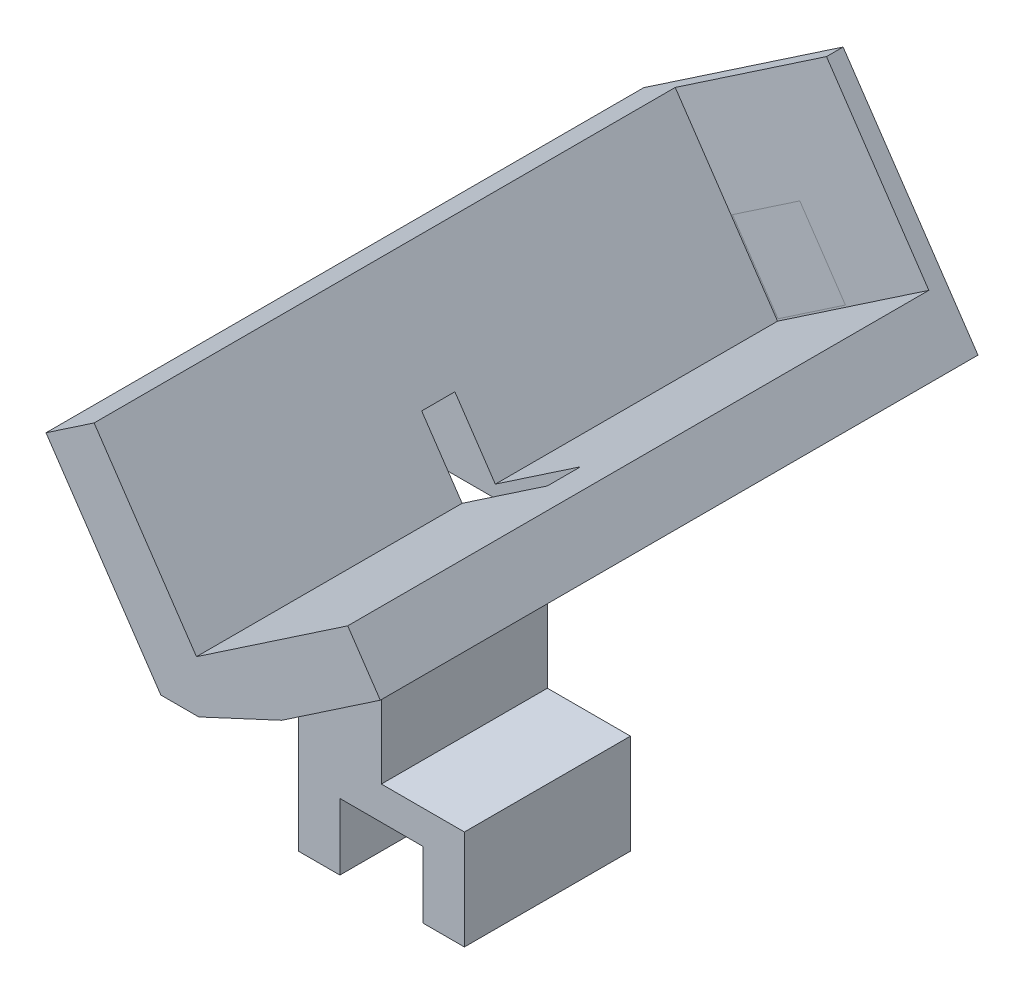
ISO-10303-21;
HEADER;
FILE_DESCRIPTION(('STEP AP214'),'2;1');
FILE_NAME('part.step','',(''),(''),'','','');
FILE_SCHEMA(('AUTOMOTIVE_DESIGN { 1 0 10303 214 1 1 1 1 }'));
ENDSEC;
DATA;
#1=APPLICATION_CONTEXT('core data for automotive mechanical design processes');
#2=APPLICATION_PROTOCOL_DEFINITION('international standard','automotive_design',2000,#1);
#3=PRODUCT_CONTEXT('',#1,'mechanical');
#4=PRODUCT('Part','Part','',(#3));
#5=PRODUCT_RELATED_PRODUCT_CATEGORY('part','',(#4));
#6=PRODUCT_DEFINITION_FORMATION('','',#4);
#7=PRODUCT_DEFINITION_CONTEXT('part definition',#1,'design');
#8=PRODUCT_DEFINITION('design','',#6,#7);
#9=PRODUCT_DEFINITION_SHAPE('','',#8);
#10=(LENGTH_UNIT() NAMED_UNIT(*) SI_UNIT(.MILLI.,.METRE.));
#11=(NAMED_UNIT(*) PLANE_ANGLE_UNIT() SI_UNIT($,.RADIAN.));
#12=(NAMED_UNIT(*) SI_UNIT($,.STERADIAN.) SOLID_ANGLE_UNIT());
#13=UNCERTAINTY_MEASURE_WITH_UNIT(LENGTH_MEASURE(1.E-05),#10,'distance_accuracy_value','');
#14=(GEOMETRIC_REPRESENTATION_CONTEXT(3) GLOBAL_UNCERTAINTY_ASSIGNED_CONTEXT((#13)) GLOBAL_UNIT_ASSIGNED_CONTEXT((#10,
#11,#12)) REPRESENTATION_CONTEXT('',''));
#15=CARTESIAN_POINT('',(0.,0.,0.));
#16=DIRECTION('',(0.,0.,1.));
#17=DIRECTION('',(1.,0.,0.));
#18=AXIS2_PLACEMENT_3D('',#15,#16,#17);
#19=CARTESIAN_POINT('',(-8.80199703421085,18.1854749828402,-19.));
#20=DIRECTION('',(0.,0.,-1.));
#21=DIRECTION('',(-1.,0.,0.));
#22=AXIS2_PLACEMENT_3D('',#19,#20,#21);
#23=PLANE('',#22);
#24=DIRECTION('',(-0.560408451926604,0.828216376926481,0.));
#25=VECTOR('',#24,1.);
#26=CARTESIAN_POINT('',(-2.6375040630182,9.07509483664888,-19.));
#27=LINE('',#26,#25);
#28=CARTESIAN_POINT('',(-2.6375040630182,9.07509483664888,-19.));
#29=VERTEX_POINT('',#28);
#30=CARTESIAN_POINT('',(-8.80199703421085,18.1854749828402,-19.));
#31=VERTEX_POINT('',#30);
#32=EDGE_CURVE('E660',#29,#31,#27,.T.);
#33=ORIENTED_EDGE('',*,*,#32,.F.);
#34=DIRECTION('',(-0.828216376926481,-0.560408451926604,0.));
#35=VECTOR('',#34,1.);
#36=CARTESIAN_POINT('',(-2.6375040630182,9.07509483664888,-19.));
#37=LINE('',#36,#35);
#38=CARTESIAN_POINT('',(6.47287608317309,15.2395878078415,-19.));
#39=VERTEX_POINT('',#38);
#40=EDGE_CURVE('E592',#39,#29,#37,.T.);
#41=ORIENTED_EDGE('',*,*,#40,.F.);
#42=DIRECTION('',(0.560408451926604,-0.828216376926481,0.));
#43=VECTOR('',#42,1.);
#44=CARTESIAN_POINT('',(6.47287608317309,15.2395878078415,-19.));
#45=LINE('',#44,#43);
#46=CARTESIAN_POINT('',(0.308383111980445,24.3499679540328,-19.));
#47=VERTEX_POINT('',#46);
#48=EDGE_CURVE('E598',#47,#39,#45,.T.);
#49=ORIENTED_EDGE('',*,*,#48,.F.);
#50=DIRECTION('',(0.828216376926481,0.560408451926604,0.));
#51=VECTOR('',#50,1.);
#52=CARTESIAN_POINT('',(-8.80199703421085,18.1854749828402,-19.));
#53=LINE('',#52,#51);
#54=EDGE_CURVE('E590',#31,#47,#53,.T.);
#55=ORIENTED_EDGE('',*,*,#54,.F.);
#56=EDGE_LOOP('',(#33,#41,#49,#55));
#57=FACE_BOUND('',#56,.T.);
#58=DIRECTION('',(-0.560408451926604,0.828216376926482,0.));
#59=VECTOR('',#58,1.);
#60=CARTESIAN_POINT('',(-4.66091514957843,20.9875172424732,-19.));
#61=LINE('',#60,#59);
#62=CARTESIAN_POINT('',(1.44753697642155,11.9599587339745,-19.));
#63=VERTEX_POINT('',#62);
#64=CARTESIAN_POINT('',(-1.29846443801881,16.0182189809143,-19.));
#65=VERTEX_POINT('',#64);
#66=EDGE_CURVE('E11',#63,#65,#61,.T.);
#67=ORIENTED_EDGE('',*,*,#66,.F.);
#68=DIRECTION('',(0.828216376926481,0.560408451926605,0.));
#69=VECTOR('',#68,1.);
#70=CARTESIAN_POINT('',(-2.69354490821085,9.15791647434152,-19.));
#71=LINE('',#70,#69);
#72=CARTESIAN_POINT('',(-2.61072327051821,9.21395731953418,-19.));
#73=VERTEX_POINT('',#72);
#74=EDGE_CURVE('E324',#73,#63,#71,.T.);
#75=ORIENTED_EDGE('',*,*,#74,.F.);
#76=DIRECTION('',(0.560408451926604,-0.828216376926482,0.));
#77=VECTOR('',#76,1.);
#78=CARTESIAN_POINT('',(-8.7191753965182,18.2415158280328,-19.));
#79=LINE('',#78,#77);
#80=CARTESIAN_POINT('',(-5.35672468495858,13.2722175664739,-19.));
#81=VERTEX_POINT('',#80);
#82=EDGE_CURVE('E328',#81,#73,#79,.T.);
#83=ORIENTED_EDGE('',*,*,#82,.F.);
#84=DIRECTION('',(-0.828216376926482,-0.560408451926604,0.));
#85=VECTOR('',#84,1.);
#86=CARTESIAN_POINT('',(-5.43954632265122,13.2161767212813,-19.));
#87=LINE('',#86,#85);
#88=EDGE_CURVE('E45',#65,#81,#87,.T.);
#89=ORIENTED_EDGE('',*,*,#88,.F.);
#90=EDGE_LOOP('',(#67,#75,#83,#89));
#91=FACE_BOUND('',#90,.T.);
#92=ADVANCED_FACE('F36',(#57,#91),#23,.F.);
#93=CARTESIAN_POINT('',(-8.80199703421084,18.1854749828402,0.));
#94=DIRECTION('',(0.828216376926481,0.560408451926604,0.));
#95=DIRECTION('',(-0.560408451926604,0.828216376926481,0.));
#96=AXIS2_PLACEMENT_3D('',#93,#94,#95);
#97=PLANE('',#96);
#98=DIRECTION('',(0.,0.,1.));
#99=VECTOR('',#98,1.);
#100=CARTESIAN_POINT('',(-2.6375040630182,9.07509483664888,0.));
#101=LINE('',#100,#99);
#102=CARTESIAN_POINT('',(-2.6375040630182,9.07509483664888,-2.));
#103=VERTEX_POINT('',#102);
#104=EDGE_CURVE('E297',#29,#103,#101,.T.);
#105=ORIENTED_EDGE('',*,*,#104,.F.);
#106=ORIENTED_EDGE('',*,*,#32,.T.);
#107=DIRECTION('',(0.,0.,1.));
#108=VECTOR('',#107,1.);
#109=CARTESIAN_POINT('',(-8.80199703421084,18.1854749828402,0.));
#110=LINE('',#109,#108);
#111=CARTESIAN_POINT('',(-8.80199703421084,18.1854749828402,16.));
#112=VERTEX_POINT('',#111);
#113=EDGE_CURVE('E295',#31,#112,#110,.T.);
#114=ORIENTED_EDGE('',*,*,#113,.T.);
#115=DIRECTION('',(0.560408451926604,-0.828216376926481,0.));
#116=VECTOR('',#115,1.);
#117=CARTESIAN_POINT('',(-8.80199703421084,18.1854749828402,16.));
#118=LINE('',#117,#116);
#119=CARTESIAN_POINT('',(-2.6375040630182,9.07509483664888,16.));
#120=VERTEX_POINT('',#119);
#121=EDGE_CURVE('E266',#112,#120,#118,.T.);
#122=ORIENTED_EDGE('',*,*,#121,.T.);
#123=CARTESIAN_POINT('',(-2.6375040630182,9.07509483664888,0.));
#124=VERTEX_POINT('',#123);
#125=EDGE_CURVE('E299',#124,#120,#101,.T.);
#126=ORIENTED_EDGE('',*,*,#125,.F.);
#127=DIRECTION('',(0.560408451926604,-0.828216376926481,0.));
#128=VECTOR('',#127,1.);
#129=CARTESIAN_POINT('',(-8.80199703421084,18.1854749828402,0.));
#130=LINE('',#129,#128);
#131=CARTESIAN_POINT('',(-5.07362573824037,12.6753900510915,0.));
#132=VERTEX_POINT('',#131);
#133=EDGE_CURVE('E563',#132,#124,#130,.T.);
#134=ORIENTED_EDGE('',*,*,#133,.F.);
#135=DIRECTION('',(0.,0.,1.));
#136=VECTOR('',#135,1.);
#137=CARTESIAN_POINT('',(-5.07362573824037,12.6753900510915,0.));
#138=LINE('',#137,#136);
#139=CARTESIAN_POINT('',(-5.07362573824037,12.6753900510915,-2.));
#140=VERTEX_POINT('',#139);
#141=EDGE_CURVE('E322',#140,#132,#138,.T.);
#142=ORIENTED_EDGE('',*,*,#141,.F.);
#143=DIRECTION('',(0.560408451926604,-0.828216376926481,0.));
#144=VECTOR('',#143,1.);
#145=CARTESIAN_POINT('',(-8.80199703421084,18.1854749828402,-2.));
#146=LINE('',#145,#144);
#147=EDGE_CURVE('E575',#140,#103,#146,.T.);
#148=ORIENTED_EDGE('',*,*,#147,.T.);
#149=EDGE_LOOP('',(#105,#106,#114,#122,#126,#134,#142,#148));
#150=FACE_BOUND('',#149,.T.);
#151=ADVANCED_FACE('F343',(#150),#97,.T.);
#152=CARTESIAN_POINT('',(-2.6375040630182,9.07509483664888,0.));
#153=DIRECTION('',(-0.560408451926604,0.828216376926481,0.));
#154=DIRECTION('',(-0.828216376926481,-0.560408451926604,0.));
#155=AXIS2_PLACEMENT_3D('',#152,#153,#154);
#156=PLANE('',#155);
#157=DIRECTION('',(0.,0.,1.));
#158=VECTOR('',#157,1.);
#159=CARTESIAN_POINT('',(6.47287608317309,15.2395878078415,0.));
#160=LINE('',#159,#158);
#161=CARTESIAN_POINT('',(6.47287608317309,15.2395878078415,16.));
#162=VERTEX_POINT('',#161);
#163=EDGE_CURVE('E300',#39,#162,#160,.T.);
#164=ORIENTED_EDGE('',*,*,#163,.F.);
#165=ORIENTED_EDGE('',*,*,#40,.T.);
#166=ORIENTED_EDGE('',*,*,#104,.T.);
#167=DIRECTION('',(0.828216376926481,0.560408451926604,0.));
#168=VECTOR('',#167,1.);
#169=CARTESIAN_POINT('',(-2.6375040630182,9.07509483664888,-2.));
#170=LINE('',#169,#168);
#171=CARTESIAN_POINT('',(2.5,12.5513611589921,-2.));
#172=VERTEX_POINT('',#171);
#173=EDGE_CURVE('E572',#103,#172,#170,.T.);
#174=ORIENTED_EDGE('',*,*,#173,.T.);
#175=DIRECTION('',(0.,0.,-1.));
#176=VECTOR('',#175,1.);
#177=CARTESIAN_POINT('',(2.5,12.5513611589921,0.));
#178=LINE('',#177,#176);
#179=CARTESIAN_POINT('',(2.5,12.5513611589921,0.));
#180=VERTEX_POINT('',#179);
#181=EDGE_CURVE('E578',#180,#172,#178,.T.);
#182=ORIENTED_EDGE('',*,*,#181,.F.);
#183=DIRECTION('',(0.828216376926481,0.560408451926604,0.));
#184=VECTOR('',#183,1.);
#185=CARTESIAN_POINT('',(-2.6375040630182,9.07509483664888,0.));
#186=LINE('',#185,#184);
#187=EDGE_CURVE('E561',#124,#180,#186,.T.);
#188=ORIENTED_EDGE('',*,*,#187,.F.);
#189=ORIENTED_EDGE('',*,*,#125,.T.);
#190=DIRECTION('',(0.828216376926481,0.560408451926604,0.));
#191=VECTOR('',#190,1.);
#192=CARTESIAN_POINT('',(-2.6375040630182,9.07509483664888,16.));
#193=LINE('',#192,#191);
#194=EDGE_CURVE('E269',#120,#162,#193,.T.);
#195=ORIENTED_EDGE('',*,*,#194,.T.);
#196=EDGE_LOOP('',(#164,#165,#166,#174,#182,#188,#189,#195));
#197=FACE_BOUND('',#196,.T.);
#198=ADVANCED_FACE('F349',(#197),#156,.T.);
#199=CARTESIAN_POINT('',(-4.78270538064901,6.,0.));
#200=DIRECTION('',(-0.828216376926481,-0.560408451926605,0.));
#201=DIRECTION('',(0.560408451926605,-0.828216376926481,0.));
#202=AXIS2_PLACEMENT_3D('',#199,#200,#201);
#203=PLANE('',#202);
#204=DIRECTION('',(0.,0.,-1.));
#205=VECTOR('',#204,1.);
#206=CARTESIAN_POINT('',(-6.35618397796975,8.32541236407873,0.));
#207=LINE('',#206,#205);
#208=CARTESIAN_POINT('',(-6.35618397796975,8.32541236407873,-2.));
#209=VERTEX_POINT('',#208);
#210=CARTESIAN_POINT('',(-6.35618397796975,8.32541236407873,-20.));
#211=VERTEX_POINT('',#210);
#212=EDGE_CURVE('E231',#209,#211,#207,.T.);
#213=ORIENTED_EDGE('',*,*,#212,.F.);
#214=DIRECTION('',(-0.560408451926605,0.828216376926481,0.));
#215=VECTOR('',#214,1.);
#216=CARTESIAN_POINT('',(-4.78270538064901,6.,-2.));
#217=LINE('',#216,#215);
#218=CARTESIAN_POINT('',(-9.29957453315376,12.6753900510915,-2.));
#219=VERTEX_POINT('',#218);
#220=EDGE_CURVE('E570',#209,#219,#217,.T.);
#221=ORIENTED_EDGE('',*,*,#220,.T.);
#222=DIRECTION('',(0.,0.,-1.));
#223=VECTOR('',#222,1.);
#224=CARTESIAN_POINT('',(-9.29957453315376,12.6753900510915,0.));
#225=LINE('',#224,#223);
#226=CARTESIAN_POINT('',(-9.29957453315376,12.6753900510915,0.));
#227=VERTEX_POINT('',#226);
#228=EDGE_CURVE('E580',#227,#219,#225,.T.);
#229=ORIENTED_EDGE('',*,*,#228,.F.);
#230=DIRECTION('',(0.,0.,-1.));
#231=VECTOR('',#230,1.);
#232=CARTESIAN_POINT('',(-9.29957453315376,12.6753900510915,1.));
#233=LINE('',#232,#231);
#234=CARTESIAN_POINT('',(-9.29957453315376,12.6753900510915,1.));
#235=VERTEX_POINT('',#234);
#236=EDGE_CURVE('E622',#235,#227,#233,.T.);
#237=ORIENTED_EDGE('',*,*,#236,.F.);
#238=DIRECTION('',(0.560408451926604,-0.828216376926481,0.));
#239=VECTOR('',#238,1.);
#240=CARTESIAN_POINT('',(-8.17875762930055,11.0189572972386,1.));
#241=LINE('',#240,#239);
#242=CARTESIAN_POINT('',(-8.17875762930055,11.0189572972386,1.));
#243=VERTEX_POINT('',#242);
#244=EDGE_CURVE('E605',#235,#243,#241,.T.);
#245=ORIENTED_EDGE('',*,*,#244,.T.);
#246=DIRECTION('',(0.,0.,-1.));
#247=VECTOR('',#246,1.);
#248=CARTESIAN_POINT('',(-8.17875762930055,11.0189572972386,1.));
#249=LINE('',#248,#247);
#250=CARTESIAN_POINT('',(-8.17875762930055,11.0189572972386,0.));
#251=VERTEX_POINT('',#250);
#252=EDGE_CURVE('E559',#243,#251,#249,.T.);
#253=ORIENTED_EDGE('',*,*,#252,.T.);
#254=DIRECTION('',(-0.560408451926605,0.828216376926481,0.));
#255=VECTOR('',#254,1.);
#256=CARTESIAN_POINT('',(-4.78270538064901,6.,0.));
#257=LINE('',#256,#255);
#258=CARTESIAN_POINT('',(-4.78270538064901,6.,0.));
#259=VERTEX_POINT('',#258);
#260=EDGE_CURVE('E557',#259,#251,#257,.T.);
#261=ORIENTED_EDGE('',*,*,#260,.F.);
#262=DIRECTION('',(0.,0.,1.));
#263=VECTOR('',#262,1.);
#264=CARTESIAN_POINT('',(-4.78270538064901,6.,0.));
#265=LINE('',#264,#263);
#266=CARTESIAN_POINT('',(-4.78270538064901,6.,16.));
#267=VERTEX_POINT('',#266);
#268=EDGE_CURVE('E291',#259,#267,#265,.T.);
#269=ORIENTED_EDGE('',*,*,#268,.T.);
#270=DIRECTION('',(-0.560408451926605,0.828216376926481,0.));
#271=VECTOR('',#270,1.);
#272=CARTESIAN_POINT('',(-4.78270538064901,6.,16.));
#273=LINE('',#272,#271);
#274=CARTESIAN_POINT('',(-11.7007543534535,16.2240454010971,16.));
#275=VERTEX_POINT('',#274);
#276=EDGE_CURVE('E255',#267,#275,#273,.T.);
#277=ORIENTED_EDGE('',*,*,#276,.T.);
#278=DIRECTION('',(0.,0.,1.));
#279=VECTOR('',#278,1.);
#280=CARTESIAN_POINT('',(-11.7007543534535,16.2240454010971,0.));
#281=LINE('',#280,#279);
#282=CARTESIAN_POINT('',(-11.7007543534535,16.2240454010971,-20.));
#283=VERTEX_POINT('',#282);
#284=EDGE_CURVE('E293',#283,#275,#281,.T.);
#285=ORIENTED_EDGE('',*,*,#284,.F.);
#286=DIRECTION('',(-0.560408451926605,0.828216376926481,0.));
#287=VECTOR('',#286,1.);
#288=CARTESIAN_POINT('',(-4.78270538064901,6.,-20.));
#289=LINE('',#288,#287);
#290=EDGE_CURVE('E583',#211,#283,#289,.T.);
#291=ORIENTED_EDGE('',*,*,#290,.F.);
#292=EDGE_LOOP('',(#213,#221,#229,#237,#245,#253,#261,#269,#277,#285,#291));
#293=FACE_BOUND('',#292,.T.);
#294=ADVANCED_FACE('F411',(#293),#203,.T.);
#295=CARTESIAN_POINT('',(0.,-4.,10.));
#296=DIRECTION('',(-1.,0.,0.));
#297=DIRECTION('',(0.,0.,1.));
#298=AXIS2_PLACEMENT_3D('',#295,#296,#297);
#299=PLANE('',#298);
#300=DIRECTION('',(0.,1.,0.));
#301=VECTOR('',#300,1.);
#302=CARTESIAN_POINT('',(0.,-4.,0.));
#303=LINE('',#302,#301);
#304=CARTESIAN_POINT('',(0.,-4.,0.));
#305=VERTEX_POINT('',#304);
#306=CARTESIAN_POINT('',(0.,0.,0.));
#307=VERTEX_POINT('',#306);
#308=EDGE_CURVE('E290',#305,#307,#303,.T.);
#309=ORIENTED_EDGE('',*,*,#308,.T.);
#310=DIRECTION('',(0.,0.,-1.));
#311=VECTOR('',#310,1.);
#312=CARTESIAN_POINT('',(0.,0.,10.));
#313=LINE('',#312,#311);
#314=CARTESIAN_POINT('',(0.,0.,10.));
#315=VERTEX_POINT('',#314);
#316=EDGE_CURVE('E325',#315,#307,#313,.T.);
#317=ORIENTED_EDGE('',*,*,#316,.F.);
#318=DIRECTION('',(0.,1.,0.));
#319=VECTOR('',#318,1.);
#320=CARTESIAN_POINT('',(0.,-4.,10.));
#321=LINE('',#320,#319);
#322=CARTESIAN_POINT('',(0.,-4.,10.));
#323=VERTEX_POINT('',#322);
#324=EDGE_CURVE('E309',#323,#315,#321,.T.);
#325=ORIENTED_EDGE('',*,*,#324,.F.);
#326=DIRECTION('',(0.,0.,-1.));
#327=VECTOR('',#326,1.);
#328=CARTESIAN_POINT('',(0.,-4.,10.));
#329=LINE('',#328,#327);
#330=EDGE_CURVE('E515',#323,#305,#329,.T.);
#331=ORIENTED_EDGE('',*,*,#330,.T.);
#332=EDGE_LOOP('',(#309,#317,#325,#331));
#333=FACE_BOUND('',#332,.T.);
#334=ADVANCED_FACE('F38',(#333),#299,.F.);
#335=CARTESIAN_POINT('',(0.,0.,10.));
#336=DIRECTION('',(0.,1.,0.));
#337=DIRECTION('',(0.,0.,1.));
#338=AXIS2_PLACEMENT_3D('',#335,#336,#337);
#339=PLANE('',#338);
#340=DIRECTION('',(1.,0.,0.));
#341=VECTOR('',#340,1.);
#342=CARTESIAN_POINT('',(0.,0.,0.));
#343=LINE('',#342,#341);
#344=CARTESIAN_POINT('',(5.,0.,0.));
#345=VERTEX_POINT('',#344);
#346=EDGE_CURVE('E469',#307,#345,#343,.T.);
#347=ORIENTED_EDGE('',*,*,#346,.T.);
#348=DIRECTION('',(0.,0.,-1.));
#349=VECTOR('',#348,1.);
#350=CARTESIAN_POINT('',(5.,0.,10.));
#351=LINE('',#350,#349);
#352=CARTESIAN_POINT('',(5.,0.,10.));
#353=VERTEX_POINT('',#352);
#354=EDGE_CURVE('E471',#353,#345,#351,.T.);
#355=ORIENTED_EDGE('',*,*,#354,.F.);
#356=DIRECTION('',(1.,0.,0.));
#357=VECTOR('',#356,1.);
#358=CARTESIAN_POINT('',(0.,0.,10.));
#359=LINE('',#358,#357);
#360=EDGE_CURVE('E524',#315,#353,#359,.T.);
#361=ORIENTED_EDGE('',*,*,#360,.F.);
#362=ORIENTED_EDGE('',*,*,#316,.T.);
#363=EDGE_LOOP('',(#347,#355,#361,#362));
#364=FACE_BOUND('',#363,.T.);
#365=ADVANCED_FACE('F459',(#364),#339,.F.);
#366=CARTESIAN_POINT('',(5.,0.,10.));
#367=DIRECTION('',(1.,0.,0.));
#368=DIRECTION('',(0.,1.,0.));
#369=AXIS2_PLACEMENT_3D('',#366,#367,#368);
#370=PLANE('',#369);
#371=DIRECTION('',(0.,-1.,0.));
#372=VECTOR('',#371,1.);
#373=CARTESIAN_POINT('',(5.,0.,0.));
#374=LINE('',#373,#372);
#375=CARTESIAN_POINT('',(5.,-4.,0.));
#376=VERTEX_POINT('',#375);
#377=EDGE_CURVE('E477',#345,#376,#374,.T.);
#378=ORIENTED_EDGE('',*,*,#377,.T.);
#379=DIRECTION('',(0.,0.,-1.));
#380=VECTOR('',#379,1.);
#381=CARTESIAN_POINT('',(5.,-4.,10.));
#382=LINE('',#381,#380);
#383=CARTESIAN_POINT('',(5.,-4.,10.));
#384=VERTEX_POINT('',#383);
#385=EDGE_CURVE('E482',#384,#376,#382,.T.);
#386=ORIENTED_EDGE('',*,*,#385,.F.);
#387=DIRECTION('',(0.,-1.,0.));
#388=VECTOR('',#387,1.);
#389=CARTESIAN_POINT('',(5.,0.,10.));
#390=LINE('',#389,#388);
#391=EDGE_CURVE('E481',#353,#384,#390,.T.);
#392=ORIENTED_EDGE('',*,*,#391,.F.);
#393=ORIENTED_EDGE('',*,*,#354,.T.);
#394=EDGE_LOOP('',(#378,#386,#392,#393));
#395=FACE_BOUND('',#394,.T.);
#396=ADVANCED_FACE('F456',(#395),#370,.F.);
#397=CARTESIAN_POINT('',(5.,-4.,10.));
#398=DIRECTION('',(0.,1.,0.));
#399=DIRECTION('',(0.,0.,1.));
#400=AXIS2_PLACEMENT_3D('',#397,#398,#399);
#401=PLANE('',#400);
#402=DIRECTION('',(1.,0.,0.));
#403=VECTOR('',#402,1.);
#404=CARTESIAN_POINT('',(5.,-4.,0.));
#405=LINE('',#404,#403);
#406=CARTESIAN_POINT('',(7.5,-4.,0.));
#407=VERTEX_POINT('',#406);
#408=EDGE_CURVE('E488',#376,#407,#405,.T.);
#409=ORIENTED_EDGE('',*,*,#408,.T.);
#410=DIRECTION('',(0.,0.,-1.));
#411=VECTOR('',#410,1.);
#412=CARTESIAN_POINT('',(7.5,-4.,10.));
#413=LINE('',#412,#411);
#414=CARTESIAN_POINT('',(7.5,-4.,10.));
#415=VERTEX_POINT('',#414);
#416=EDGE_CURVE('E532',#415,#407,#413,.T.);
#417=ORIENTED_EDGE('',*,*,#416,.F.);
#418=DIRECTION('',(1.,0.,0.));
#419=VECTOR('',#418,1.);
#420=CARTESIAN_POINT('',(5.,-4.,10.));
#421=LINE('',#420,#419);
#422=EDGE_CURVE('E537',#384,#415,#421,.T.);
#423=ORIENTED_EDGE('',*,*,#422,.F.);
#424=ORIENTED_EDGE('',*,*,#385,.T.);
#425=EDGE_LOOP('',(#409,#417,#423,#424));
#426=FACE_BOUND('',#425,.T.);
#427=ADVANCED_FACE('F452',(#426),#401,.F.);
#428=CARTESIAN_POINT('',(7.5,-4.,10.));
#429=DIRECTION('',(-1.,0.,0.));
#430=DIRECTION('',(0.,-1.,0.));
#431=AXIS2_PLACEMENT_3D('',#428,#429,#430);
#432=PLANE('',#431);
#433=DIRECTION('',(0.,1.,0.));
#434=VECTOR('',#433,1.);
#435=CARTESIAN_POINT('',(7.5,-4.,0.));
#436=LINE('',#435,#434);
#437=CARTESIAN_POINT('',(7.5,2.,0.));
#438=VERTEX_POINT('',#437);
#439=EDGE_CURVE('E490',#407,#438,#436,.T.);
#440=ORIENTED_EDGE('',*,*,#439,.T.);
#441=DIRECTION('',(0.,0.,-1.));
#442=VECTOR('',#441,1.);
#443=CARTESIAN_POINT('',(7.5,2.,10.));
#444=LINE('',#443,#442);
#445=CARTESIAN_POINT('',(7.5,2.,10.));
#446=VERTEX_POINT('',#445);
#447=EDGE_CURVE('E529',#446,#438,#444,.T.);
#448=ORIENTED_EDGE('',*,*,#447,.F.);
#449=DIRECTION('',(0.,1.,0.));
#450=VECTOR('',#449,1.);
#451=CARTESIAN_POINT('',(7.5,-4.,10.));
#452=LINE('',#451,#450);
#453=EDGE_CURVE('E508',#415,#446,#452,.T.);
#454=ORIENTED_EDGE('',*,*,#453,.F.);
#455=ORIENTED_EDGE('',*,*,#416,.T.);
#456=EDGE_LOOP('',(#440,#448,#454,#455));
#457=FACE_BOUND('',#456,.T.);
#458=ADVANCED_FACE('F448',(#457),#432,.F.);
#459=CARTESIAN_POINT('',(7.5,2.,10.));
#460=DIRECTION('',(0.,-1.,0.));
#461=DIRECTION('',(0.,0.,-1.));
#462=AXIS2_PLACEMENT_3D('',#459,#460,#461);
#463=PLANE('',#462);
#464=DIRECTION('',(-1.,0.,0.));
#465=VECTOR('',#464,1.);
#466=CARTESIAN_POINT('',(7.5,2.,0.));
#467=LINE('',#466,#465);
#468=CARTESIAN_POINT('',(2.5,2.,0.));
#469=VERTEX_POINT('',#468);
#470=EDGE_CURVE('E495',#438,#469,#467,.T.);
#471=ORIENTED_EDGE('',*,*,#470,.T.);
#472=DIRECTION('',(0.,0.,1.));
#473=VECTOR('',#472,1.);
#474=CARTESIAN_POINT('',(2.5,2.,0.));
#475=LINE('',#474,#473);
#476=CARTESIAN_POINT('',(2.5,2.,10.));
#477=VERTEX_POINT('',#476);
#478=EDGE_CURVE('E306',#469,#477,#475,.T.);
#479=ORIENTED_EDGE('',*,*,#478,.T.);
#480=DIRECTION('',(-1.,0.,0.));
#481=VECTOR('',#480,1.);
#482=CARTESIAN_POINT('',(7.5,2.,10.));
#483=LINE('',#482,#481);
#484=EDGE_CURVE('E504',#446,#477,#483,.T.);
#485=ORIENTED_EDGE('',*,*,#484,.F.);
#486=ORIENTED_EDGE('',*,*,#447,.T.);
#487=EDGE_LOOP('',(#471,#479,#485,#486));
#488=FACE_BOUND('',#487,.T.);
#489=ADVANCED_FACE('F444',(#488),#463,.F.);
#490=CARTESIAN_POINT('',(-2.5,2.,10.));
#491=DIRECTION('',(1.,0.,0.));
#492=DIRECTION('',(0.,1.,0.));
#493=AXIS2_PLACEMENT_3D('',#490,#491,#492);
#494=PLANE('',#493);
#495=DIRECTION('',(0.,-1.,0.));
#496=VECTOR('',#495,1.);
#497=CARTESIAN_POINT('',(-2.5,2.,0.));
#498=LINE('',#497,#496);
#499=CARTESIAN_POINT('',(-2.5,6.,0.));
#500=VERTEX_POINT('',#499);
#501=CARTESIAN_POINT('',(-2.5,-4.,0.));
#502=VERTEX_POINT('',#501);
#503=EDGE_CURVE('E498',#500,#502,#498,.T.);
#504=ORIENTED_EDGE('',*,*,#503,.T.);
#505=DIRECTION('',(0.,0.,-1.));
#506=VECTOR('',#505,1.);
#507=CARTESIAN_POINT('',(-2.5,-4.,10.));
#508=LINE('',#507,#506);
#509=CARTESIAN_POINT('',(-2.5,-4.,10.));
#510=VERTEX_POINT('',#509);
#511=EDGE_CURVE('E527',#510,#502,#508,.T.);
#512=ORIENTED_EDGE('',*,*,#511,.F.);
#513=DIRECTION('',(0.,-1.,0.));
#514=VECTOR('',#513,1.);
#515=CARTESIAN_POINT('',(-2.5,2.,10.));
#516=LINE('',#515,#514);
#517=CARTESIAN_POINT('',(-2.5,6.,10.));
#518=VERTEX_POINT('',#517);
#519=EDGE_CURVE('E507',#518,#510,#516,.T.);
#520=ORIENTED_EDGE('',*,*,#519,.F.);
#521=DIRECTION('',(0.,0.,1.));
#522=VECTOR('',#521,1.);
#523=CARTESIAN_POINT('',(-2.5,6.,0.));
#524=LINE('',#523,#522);
#525=EDGE_CURVE('E287',#500,#518,#524,.T.);
#526=ORIENTED_EDGE('',*,*,#525,.F.);
#527=EDGE_LOOP('',(#504,#512,#520,#526));
#528=FACE_BOUND('',#527,.T.);
#529=ADVANCED_FACE('F440',(#528),#494,.F.);
#530=CARTESIAN_POINT('',(-2.5,-4.,10.));
#531=DIRECTION('',(0.,1.,0.));
#532=DIRECTION('',(0.,0.,1.));
#533=AXIS2_PLACEMENT_3D('',#530,#531,#532);
#534=PLANE('',#533);
#535=DIRECTION('',(1.,0.,0.));
#536=VECTOR('',#535,1.);
#537=CARTESIAN_POINT('',(-2.5,-4.,0.));
#538=LINE('',#537,#536);
#539=EDGE_CURVE('E520',#502,#305,#538,.T.);
#540=ORIENTED_EDGE('',*,*,#539,.T.);
#541=ORIENTED_EDGE('',*,*,#330,.F.);
#542=DIRECTION('',(1.,0.,0.));
#543=VECTOR('',#542,1.);
#544=CARTESIAN_POINT('',(-2.5,-4.,10.));
#545=LINE('',#544,#543);
#546=EDGE_CURVE('E514',#510,#323,#545,.T.);
#547=ORIENTED_EDGE('',*,*,#546,.F.);
#548=ORIENTED_EDGE('',*,*,#511,.T.);
#549=EDGE_LOOP('',(#540,#541,#547,#548));
#550=FACE_BOUND('',#549,.T.);
#551=ADVANCED_FACE('F433',(#550),#534,.F.);
#552=CARTESIAN_POINT('',(0.,0.,10.));
#553=DIRECTION('',(0.,0.,-1.));
#554=DIRECTION('',(-1.,0.,0.));
#555=AXIS2_PLACEMENT_3D('',#552,#553,#554);
#556=PLANE('',#555);
#557=DIRECTION('',(0.,1.,0.));
#558=VECTOR('',#557,1.);
#559=CARTESIAN_POINT('',(2.5,2.,10.));
#560=LINE('',#559,#558);
#561=CARTESIAN_POINT('',(2.5,8.32541236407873,10.));
#562=VERTEX_POINT('',#561);
#563=EDGE_CURVE('E286',#477,#562,#560,.T.);
#564=ORIENTED_EDGE('',*,*,#563,.T.);
#565=DIRECTION('',(-0.906732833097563,-0.421705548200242,0.));
#566=VECTOR('',#565,1.);
#567=CARTESIAN_POINT('',(-2.73883452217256,5.88892224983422,10.));
#568=LINE('',#567,#566);
#569=EDGE_CURVE('E282',#562,#518,#568,.T.);
#570=ORIENTED_EDGE('',*,*,#569,.T.);
#571=ORIENTED_EDGE('',*,*,#519,.T.);
#572=ORIENTED_EDGE('',*,*,#546,.T.);
#573=ORIENTED_EDGE('',*,*,#324,.T.);
#574=ORIENTED_EDGE('',*,*,#360,.T.);
#575=ORIENTED_EDGE('',*,*,#391,.T.);
#576=ORIENTED_EDGE('',*,*,#422,.T.);
#577=ORIENTED_EDGE('',*,*,#453,.T.);
#578=ORIENTED_EDGE('',*,*,#484,.T.);
#579=EDGE_LOOP('',(#564,#570,#571,#572,#573,#574,#575,#576,#577,#578));
#580=FACE_BOUND('',#579,.T.);
#581=ADVANCED_FACE('F430',(#580),#556,.F.);
#582=CARTESIAN_POINT('',(0.,0.,0.));
#583=DIRECTION('',(0.,0.,-1.));
#584=DIRECTION('',(-1.,0.,0.));
#585=AXIS2_PLACEMENT_3D('',#582,#583,#584);
#586=PLANE('',#585);
#587=ORIENTED_EDGE('',*,*,#539,.F.);
#588=ORIENTED_EDGE('',*,*,#503,.F.);
#589=DIRECTION('',(-1.,0.,0.));
#590=VECTOR('',#589,1.);
#591=CARTESIAN_POINT('',(-2.5,6.,0.));
#592=LINE('',#591,#590);
#593=EDGE_CURVE('E546',#500,#259,#592,.T.);
#594=ORIENTED_EDGE('',*,*,#593,.T.);
#595=ORIENTED_EDGE('',*,*,#260,.T.);
#596=DIRECTION('',(-0.828216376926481,-0.560408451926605,0.));
#597=VECTOR('',#596,1.);
#598=CARTESIAN_POINT('',(-9.83519038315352,9.89814039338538,0.));
#599=LINE('',#598,#597);
#600=CARTESIAN_POINT('',(-9.83519038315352,9.89814039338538,0.));
#601=VERTEX_POINT('',#600);
#602=EDGE_CURVE('E603',#251,#601,#599,.T.);
#603=ORIENTED_EDGE('',*,*,#602,.T.);
#604=DIRECTION('',(-0.560408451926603,0.828216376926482,0.));
#605=VECTOR('',#604,1.);
#606=CARTESIAN_POINT('',(-10.9560072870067,11.5545731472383,0.));
#607=LINE('',#606,#605);
#608=CARTESIAN_POINT('',(-10.9560072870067,11.5545731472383,0.));
#609=VERTEX_POINT('',#608);
#610=EDGE_CURVE('E618',#601,#609,#607,.T.);
#611=ORIENTED_EDGE('',*,*,#610,.T.);
#612=DIRECTION('',(0.828216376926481,0.560408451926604,0.));
#613=VECTOR('',#612,1.);
#614=CARTESIAN_POINT('',(-9.29957453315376,12.6753900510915,0.));
#615=LINE('',#614,#613);
#616=EDGE_CURVE('E608',#609,#227,#615,.T.);
#617=ORIENTED_EDGE('',*,*,#616,.T.);
#618=DIRECTION('',(-1.,0.,0.));
#619=VECTOR('',#618,1.);
#620=CARTESIAN_POINT('',(-10.0178165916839,12.6753900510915,0.));
#621=LINE('',#620,#619);
#622=EDGE_CURVE('E634',#132,#227,#621,.T.);
#623=ORIENTED_EDGE('',*,*,#622,.F.);
#624=ORIENTED_EDGE('',*,*,#133,.T.);
#625=ORIENTED_EDGE('',*,*,#187,.T.);
#626=DIRECTION('',(0.,1.,0.));
#627=VECTOR('',#626,1.);
#628=CARTESIAN_POINT('',(2.5,12.6753900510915,0.));
#629=LINE('',#628,#627);
#630=CARTESIAN_POINT('',(2.5,8.32541236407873,0.));
#631=VERTEX_POINT('',#630);
#632=EDGE_CURVE('E625',#631,#180,#629,.T.);
#633=ORIENTED_EDGE('',*,*,#632,.F.);
#634=DIRECTION('',(0.,1.,0.));
#635=VECTOR('',#634,1.);
#636=CARTESIAN_POINT('',(2.5,2.,0.));
#637=LINE('',#636,#635);
#638=EDGE_CURVE('E315',#469,#631,#637,.T.);
#639=ORIENTED_EDGE('',*,*,#638,.F.);
#640=ORIENTED_EDGE('',*,*,#470,.F.);
#641=ORIENTED_EDGE('',*,*,#439,.F.);
#642=ORIENTED_EDGE('',*,*,#408,.F.);
#643=ORIENTED_EDGE('',*,*,#377,.F.);
#644=ORIENTED_EDGE('',*,*,#346,.F.);
#645=ORIENTED_EDGE('',*,*,#308,.F.);
#646=EDGE_LOOP('',(#587,#588,#594,#595,#603,#611,#617,#623,#624,#625,#633,#639,#640,#641,#642,
#643,#644,#645));
#647=FACE_BOUND('',#646,.T.);
#648=CARTESIAN_POINT('',(-9.56738245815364,11.2867652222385,0.));
#649=DIRECTION('',(0.,0.,-1.));
#650=DIRECTION('',(-1.,0.,0.));
#651=AXIS2_PLACEMENT_3D('',#648,#649,#650);
#652=CIRCLE('',#651,0.500000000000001);
#653=CARTESIAN_POINT('',(-10.0673824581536,11.2867652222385,0.));
#654=VERTEX_POINT('',#653);
#655=EDGE_CURVE('E591',#654,#654,#652,.T.);
#656=ORIENTED_EDGE('',*,*,#655,.F.);
#657=EDGE_LOOP('',(#656));
#658=FACE_BOUND('',#657,.T.);
#659=ADVANCED_FACE('F409',(#647,#658),#586,.T.);
#660=CARTESIAN_POINT('',(-2.5,6.,0.));
#661=DIRECTION('',(0.,-1.,0.));
#662=DIRECTION('',(0.,0.,-1.));
#663=AXIS2_PLACEMENT_3D('',#660,#661,#662);
#664=PLANE('',#663);
#665=ORIENTED_EDGE('',*,*,#593,.F.);
#666=ORIENTED_EDGE('',*,*,#525,.T.);
#667=DIRECTION('',(0.,0.,-1.));
#668=VECTOR('',#667,1.);
#669=CARTESIAN_POINT('',(-2.5,6.,16.));
#670=LINE('',#669,#668);
#671=CARTESIAN_POINT('',(-2.5,6.,16.));
#672=VERTEX_POINT('',#671);
#673=EDGE_CURVE('E280',#672,#518,#670,.T.);
#674=ORIENTED_EDGE('',*,*,#673,.F.);
#675=DIRECTION('',(-1.,0.,0.));
#676=VECTOR('',#675,1.);
#677=CARTESIAN_POINT('',(-2.5,6.,16.));
#678=LINE('',#677,#676);
#679=EDGE_CURVE('E252',#672,#267,#678,.T.);
#680=ORIENTED_EDGE('',*,*,#679,.T.);
#681=ORIENTED_EDGE('',*,*,#268,.F.);
#682=EDGE_LOOP('',(#665,#666,#674,#680,#681));
#683=FACE_BOUND('',#682,.T.);
#684=ADVANCED_FACE('F405',(#683),#664,.T.);
#685=CARTESIAN_POINT('',(-11.7007543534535,16.2240454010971,0.));
#686=DIRECTION('',(-0.560408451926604,0.828216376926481,0.));
#687=DIRECTION('',(-0.828216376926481,-0.560408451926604,0.));
#688=AXIS2_PLACEMENT_3D('',#685,#686,#687);
#689=PLANE('',#688);
#690=ORIENTED_EDGE('',*,*,#284,.T.);
#691=DIRECTION('',(0.828216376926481,0.560408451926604,0.));
#692=VECTOR('',#691,1.);
#693=CARTESIAN_POINT('',(-11.7007543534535,16.2240454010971,16.));
#694=LINE('',#693,#692);
#695=EDGE_CURVE('E263',#275,#112,#694,.T.);
#696=ORIENTED_EDGE('',*,*,#695,.T.);
#697=ORIENTED_EDGE('',*,*,#113,.F.);
#698=ORIENTED_EDGE('',*,*,#54,.T.);
#699=DIRECTION('',(0.,0.,-1.));
#700=VECTOR('',#699,1.);
#701=CARTESIAN_POINT('',(0.308383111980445,24.3499679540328,-19.));
#702=LINE('',#701,#700);
#703=CARTESIAN_POINT('',(0.308383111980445,24.3499679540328,-20.));
#704=VERTEX_POINT('',#703);
#705=EDGE_CURVE('E586',#47,#704,#702,.T.);
#706=ORIENTED_EDGE('',*,*,#705,.T.);
#707=DIRECTION('',(0.828216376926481,0.560408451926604,0.));
#708=VECTOR('',#707,1.);
#709=CARTESIAN_POINT('',(-11.7007543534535,16.2240454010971,-20.));
#710=LINE('',#709,#708);
#711=EDGE_CURVE('E257',#283,#704,#710,.T.);
#712=ORIENTED_EDGE('',*,*,#711,.F.);
#713=EDGE_LOOP('',(#690,#696,#697,#698,#706,#712));
#714=FACE_BOUND('',#713,.T.);
#715=ADVANCED_FACE('F408',(#714),#689,.T.);
#716=CARTESIAN_POINT('',(6.47287608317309,15.2395878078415,0.));
#717=DIRECTION('',(0.828216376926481,0.560408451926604,0.));
#718=DIRECTION('',(-0.560408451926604,0.828216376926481,0.));
#719=AXIS2_PLACEMENT_3D('',#716,#717,#718);
#720=PLANE('',#719);
#721=DIRECTION('',(0.560408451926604,-0.828216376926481,0.));
#722=VECTOR('',#721,1.);
#723=CARTESIAN_POINT('',(6.47287608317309,15.2395878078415,-20.));
#724=LINE('',#723,#722);
#725=CARTESIAN_POINT('',(8.43430566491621,12.3408304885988,-20.));
#726=VERTEX_POINT('',#725);
#727=EDGE_CURVE('E251',#704,#726,#724,.T.);
#728=ORIENTED_EDGE('',*,*,#727,.F.);
#729=ORIENTED_EDGE('',*,*,#705,.F.);
#730=ORIENTED_EDGE('',*,*,#48,.T.);
#731=ORIENTED_EDGE('',*,*,#163,.T.);
#732=DIRECTION('',(0.560408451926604,-0.828216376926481,0.));
#733=VECTOR('',#732,1.);
#734=CARTESIAN_POINT('',(6.47287608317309,15.2395878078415,16.));
#735=LINE('',#734,#733);
#736=CARTESIAN_POINT('',(8.43430566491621,12.3408304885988,16.));
#737=VERTEX_POINT('',#736);
#738=EDGE_CURVE('E272',#162,#737,#735,.T.);
#739=ORIENTED_EDGE('',*,*,#738,.T.);
#740=DIRECTION('',(0.,0.,1.));
#741=VECTOR('',#740,1.);
#742=CARTESIAN_POINT('',(8.43430566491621,12.3408304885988,0.));
#743=LINE('',#742,#741);
#744=EDGE_CURVE('E302',#726,#737,#743,.T.);
#745=ORIENTED_EDGE('',*,*,#744,.F.);
#746=EDGE_LOOP('',(#728,#729,#730,#731,#739,#745));
#747=FACE_BOUND('',#746,.T.);
#748=ADVANCED_FACE('F416',(#747),#720,.T.);
#749=CARTESIAN_POINT('',(8.43430566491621,12.3408304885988,0.));
#750=DIRECTION('',(0.560408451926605,-0.828216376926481,0.));
#751=DIRECTION('',(0.828216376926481,0.560408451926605,0.));
#752=AXIS2_PLACEMENT_3D('',#749,#750,#751);
#753=PLANE('',#752);
#754=ORIENTED_EDGE('',*,*,#744,.T.);
#755=DIRECTION('',(-0.828216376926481,-0.560408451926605,0.));
#756=VECTOR('',#755,1.);
#757=CARTESIAN_POINT('',(8.43430566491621,12.3408304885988,16.));
#758=LINE('',#757,#756);
#759=CARTESIAN_POINT('',(2.5,8.32541236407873,16.));
#760=VERTEX_POINT('',#759);
#761=EDGE_CURVE('E275',#737,#760,#758,.T.);
#762=ORIENTED_EDGE('',*,*,#761,.T.);
#763=DIRECTION('',(0.,0.,-1.));
#764=VECTOR('',#763,1.);
#765=CARTESIAN_POINT('',(2.5,8.32541236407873,16.));
#766=LINE('',#765,#764);
#767=EDGE_CURVE('E247',#760,#562,#766,.T.);
#768=ORIENTED_EDGE('',*,*,#767,.T.);
#769=DIRECTION('',(0.,0.,1.));
#770=VECTOR('',#769,1.);
#771=CARTESIAN_POINT('',(2.5,8.32541236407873,0.));
#772=LINE('',#771,#770);
#773=EDGE_CURVE('E304',#631,#562,#772,.T.);
#774=ORIENTED_EDGE('',*,*,#773,.F.);
#775=CARTESIAN_POINT('',(2.5,8.32541236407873,-2.));
#776=VERTEX_POINT('',#775);
#777=EDGE_CURVE('E244',#631,#776,#766,.T.);
#778=ORIENTED_EDGE('',*,*,#777,.T.);
#779=CARTESIAN_POINT('',(2.5,8.32541236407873,-20.));
#780=VERTEX_POINT('',#779);
#781=EDGE_CURVE('E228',#776,#780,#766,.T.);
#782=ORIENTED_EDGE('',*,*,#781,.T.);
#783=DIRECTION('',(-0.828216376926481,-0.560408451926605,0.));
#784=VECTOR('',#783,1.);
#785=CARTESIAN_POINT('',(8.43430566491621,12.3408304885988,-20.));
#786=LINE('',#785,#784);
#787=EDGE_CURVE('E241',#726,#780,#786,.T.);
#788=ORIENTED_EDGE('',*,*,#787,.F.);
#789=EDGE_LOOP('',(#754,#762,#768,#774,#778,#782,#788));
#790=FACE_BOUND('',#789,.T.);
#791=ADVANCED_FACE('F240',(#790),#753,.T.);
#792=CARTESIAN_POINT('',(2.5,2.,0.));
#793=DIRECTION('',(1.,0.,0.));
#794=DIRECTION('',(0.,0.,-1.));
#795=AXIS2_PLACEMENT_3D('',#792,#793,#794);
#796=PLANE('',#795);
#797=ORIENTED_EDGE('',*,*,#563,.F.);
#798=ORIENTED_EDGE('',*,*,#478,.F.);
#799=ORIENTED_EDGE('',*,*,#638,.T.);
#800=ORIENTED_EDGE('',*,*,#773,.T.);
#801=EDGE_LOOP('',(#797,#798,#799,#800));
#802=FACE_BOUND('',#801,.T.);
#803=ADVANCED_FACE('F398',(#802),#796,.T.);
#804=CARTESIAN_POINT('',(-4.78270538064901,6.,-20.));
#805=DIRECTION('',(0.,0.,-1.));
#806=DIRECTION('',(-1.,0.,0.));
#807=AXIS2_PLACEMENT_3D('',#804,#805,#806);
#808=PLANE('',#807);
#809=DIRECTION('',(-1.,0.,0.));
#810=VECTOR('',#809,1.);
#811=CARTESIAN_POINT('',(-9.60986710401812,8.32541236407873,-20.));
#812=LINE('',#811,#810);
#813=EDGE_CURVE('E225',#780,#211,#812,.T.);
#814=ORIENTED_EDGE('',*,*,#813,.T.);
#815=ORIENTED_EDGE('',*,*,#290,.T.);
#816=ORIENTED_EDGE('',*,*,#711,.T.);
#817=ORIENTED_EDGE('',*,*,#727,.T.);
#818=ORIENTED_EDGE('',*,*,#787,.T.);
#819=EDGE_LOOP('',(#814,#815,#816,#817,#818));
#820=FACE_BOUND('',#819,.T.);
#821=ADVANCED_FACE('F249',(#820),#808,.T.);
#822=CARTESIAN_POINT('',(2.5,8.32541236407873,16.));
#823=DIRECTION('',(0.421705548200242,-0.906732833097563,0.));
#824=DIRECTION('',(0.906732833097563,0.421705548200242,0.));
#825=AXIS2_PLACEMENT_3D('',#822,#823,#824);
#826=PLANE('',#825);
#827=ORIENTED_EDGE('',*,*,#569,.F.);
#828=ORIENTED_EDGE('',*,*,#767,.F.);
#829=DIRECTION('',(-0.906732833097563,-0.421705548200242,0.));
#830=VECTOR('',#829,1.);
#831=CARTESIAN_POINT('',(2.5,8.32541236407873,16.));
#832=LINE('',#831,#830);
#833=EDGE_CURVE('E245',#760,#672,#832,.T.);
#834=ORIENTED_EDGE('',*,*,#833,.T.);
#835=ORIENTED_EDGE('',*,*,#673,.T.);
#836=EDGE_LOOP('',(#827,#828,#834,#835));
#837=FACE_BOUND('',#836,.T.);
#838=ADVANCED_FACE('F397',(#837),#826,.T.);
#839=CARTESIAN_POINT('',(-4.78270538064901,6.,16.));
#840=DIRECTION('',(0.,0.,-1.));
#841=DIRECTION('',(-1.,0.,0.));
#842=AXIS2_PLACEMENT_3D('',#839,#840,#841);
#843=PLANE('',#842);
#844=ORIENTED_EDGE('',*,*,#679,.F.);
#845=ORIENTED_EDGE('',*,*,#833,.F.);
#846=ORIENTED_EDGE('',*,*,#761,.F.);
#847=ORIENTED_EDGE('',*,*,#738,.F.);
#848=ORIENTED_EDGE('',*,*,#194,.F.);
#849=ORIENTED_EDGE('',*,*,#121,.F.);
#850=ORIENTED_EDGE('',*,*,#695,.F.);
#851=ORIENTED_EDGE('',*,*,#276,.F.);
#852=EDGE_LOOP('',(#844,#845,#846,#847,#848,#849,#850,#851));
#853=FACE_BOUND('',#852,.T.);
#854=ADVANCED_FACE('F390',(#853),#843,.F.);
#855=CARTESIAN_POINT('',(-10.0178165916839,12.6753900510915,-2.));
#856=DIRECTION('',(0.,1.,0.));
#857=DIRECTION('',(0.,0.,1.));
#858=AXIS2_PLACEMENT_3D('',#855,#856,#857);
#859=PLANE('',#858);
#860=ORIENTED_EDGE('',*,*,#228,.T.);
#861=DIRECTION('',(-1.,0.,0.));
#862=VECTOR('',#861,1.);
#863=CARTESIAN_POINT('',(-10.0178165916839,12.6753900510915,-2.));
#864=LINE('',#863,#862);
#865=EDGE_CURVE('E565',#140,#219,#864,.T.);
#866=ORIENTED_EDGE('',*,*,#865,.F.);
#867=ORIENTED_EDGE('',*,*,#141,.T.);
#868=ORIENTED_EDGE('',*,*,#622,.T.);
#869=EDGE_LOOP('',(#860,#866,#867,#868));
#870=FACE_BOUND('',#869,.T.);
#871=ADVANCED_FACE('F387',(#870),#859,.F.);
#872=CARTESIAN_POINT('',(2.5,12.6753900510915,-2.));
#873=DIRECTION('',(1.,0.,0.));
#874=DIRECTION('',(0.,0.,-1.));
#875=AXIS2_PLACEMENT_3D('',#872,#873,#874);
#876=PLANE('',#875);
#877=ORIENTED_EDGE('',*,*,#181,.T.);
#878=DIRECTION('',(0.,1.,0.));
#879=VECTOR('',#878,1.);
#880=CARTESIAN_POINT('',(2.5,12.6753900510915,-2.));
#881=LINE('',#880,#879);
#882=EDGE_CURVE('E631',#776,#172,#881,.T.);
#883=ORIENTED_EDGE('',*,*,#882,.F.);
#884=ORIENTED_EDGE('',*,*,#777,.F.);
#885=ORIENTED_EDGE('',*,*,#632,.T.);
#886=EDGE_LOOP('',(#877,#883,#884,#885));
#887=FACE_BOUND('',#886,.T.);
#888=ADVANCED_FACE('F385',(#887),#876,.F.);
#889=CARTESIAN_POINT('',(-10.0178165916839,2.,-2.));
#890=DIRECTION('',(0.,0.,1.));
#891=DIRECTION('',(1.,0.,0.));
#892=AXIS2_PLACEMENT_3D('',#889,#890,#891);
#893=PLANE('',#892);
#894=DIRECTION('',(-1.,0.,0.));
#895=VECTOR('',#894,1.);
#896=CARTESIAN_POINT('',(-9.60986710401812,8.32541236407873,-2.));
#897=LINE('',#896,#895);
#898=EDGE_CURVE('E235',#776,#209,#897,.T.);
#899=ORIENTED_EDGE('',*,*,#898,.F.);
#900=ORIENTED_EDGE('',*,*,#882,.T.);
#901=ORIENTED_EDGE('',*,*,#173,.F.);
#902=ORIENTED_EDGE('',*,*,#147,.F.);
#903=ORIENTED_EDGE('',*,*,#865,.T.);
#904=ORIENTED_EDGE('',*,*,#220,.F.);
#905=EDGE_LOOP('',(#899,#900,#901,#902,#903,#904));
#906=FACE_BOUND('',#905,.T.);
#907=ADVANCED_FACE('F375',(#906),#893,.T.);
#908=CARTESIAN_POINT('',(-9.29957453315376,12.6753900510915,1.));
#909=DIRECTION('',(-0.560408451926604,0.828216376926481,0.));
#910=DIRECTION('',(-0.828216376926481,-0.560408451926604,0.));
#911=AXIS2_PLACEMENT_3D('',#908,#909,#910);
#912=PLANE('',#911);
#913=ORIENTED_EDGE('',*,*,#616,.F.);
#914=DIRECTION('',(0.,0.,-1.));
#915=VECTOR('',#914,1.);
#916=CARTESIAN_POINT('',(-10.9560072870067,11.5545731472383,1.));
#917=LINE('',#916,#915);
#918=CARTESIAN_POINT('',(-10.9560072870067,11.5545731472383,1.));
#919=VERTEX_POINT('',#918);
#920=EDGE_CURVE('E626',#919,#609,#917,.T.);
#921=ORIENTED_EDGE('',*,*,#920,.F.);
#922=DIRECTION('',(0.828216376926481,0.560408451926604,0.));
#923=VECTOR('',#922,1.);
#924=CARTESIAN_POINT('',(-9.29957453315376,12.6753900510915,1.));
#925=LINE('',#924,#923);
#926=EDGE_CURVE('E614',#919,#235,#925,.T.);
#927=ORIENTED_EDGE('',*,*,#926,.T.);
#928=ORIENTED_EDGE('',*,*,#236,.T.);
#929=EDGE_LOOP('',(#913,#921,#927,#928));
#930=FACE_BOUND('',#929,.T.);
#931=ADVANCED_FACE('F371',(#930),#912,.T.);
#932=CARTESIAN_POINT('',(-10.9560072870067,11.5545731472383,1.));
#933=DIRECTION('',(-0.828216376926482,-0.560408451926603,0.));
#934=DIRECTION('',(0.560408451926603,-0.828216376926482,0.));
#935=AXIS2_PLACEMENT_3D('',#932,#933,#934);
#936=PLANE('',#935);
#937=ORIENTED_EDGE('',*,*,#610,.F.);
#938=DIRECTION('',(0.,0.,-1.));
#939=VECTOR('',#938,1.);
#940=CARTESIAN_POINT('',(-9.83519038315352,9.89814039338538,1.));
#941=LINE('',#940,#939);
#942=CARTESIAN_POINT('',(-9.83519038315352,9.89814039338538,1.));
#943=VERTEX_POINT('',#942);
#944=EDGE_CURVE('E628',#943,#601,#941,.T.);
#945=ORIENTED_EDGE('',*,*,#944,.F.);
#946=DIRECTION('',(-0.560408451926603,0.828216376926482,0.));
#947=VECTOR('',#946,1.);
#948=CARTESIAN_POINT('',(-10.9560072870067,11.5545731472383,1.));
#949=LINE('',#948,#947);
#950=EDGE_CURVE('E611',#943,#919,#949,.T.);
#951=ORIENTED_EDGE('',*,*,#950,.T.);
#952=ORIENTED_EDGE('',*,*,#920,.T.);
#953=EDGE_LOOP('',(#937,#945,#951,#952));
#954=FACE_BOUND('',#953,.T.);
#955=ADVANCED_FACE('F374',(#954),#936,.T.);
#956=CARTESIAN_POINT('',(-9.83519038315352,9.89814039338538,1.));
#957=DIRECTION('',(0.560408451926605,-0.828216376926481,0.));
#958=DIRECTION('',(0.828216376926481,0.560408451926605,0.));
#959=AXIS2_PLACEMENT_3D('',#956,#957,#958);
#960=PLANE('',#959);
#961=ORIENTED_EDGE('',*,*,#602,.F.);
#962=ORIENTED_EDGE('',*,*,#252,.F.);
#963=DIRECTION('',(-0.828216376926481,-0.560408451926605,0.));
#964=VECTOR('',#963,1.);
#965=CARTESIAN_POINT('',(-9.83519038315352,9.89814039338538,1.));
#966=LINE('',#965,#964);
#967=EDGE_CURVE('E607',#243,#943,#966,.T.);
#968=ORIENTED_EDGE('',*,*,#967,.T.);
#969=ORIENTED_EDGE('',*,*,#944,.T.);
#970=EDGE_LOOP('',(#961,#962,#968,#969));
#971=FACE_BOUND('',#970,.T.);
#972=ADVANCED_FACE('F365',(#971),#960,.T.);
#973=CARTESIAN_POINT('',(-9.29957453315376,12.6753900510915,1.));
#974=DIRECTION('',(0.,0.,1.));
#975=DIRECTION('',(1.,0.,0.));
#976=AXIS2_PLACEMENT_3D('',#973,#974,#975);
#977=PLANE('',#976);
#978=CARTESIAN_POINT('',(-9.56738245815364,11.2867652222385,1.));
#979=DIRECTION('',(0.,0.,-1.));
#980=DIRECTION('',(-1.,0.,0.));
#981=AXIS2_PLACEMENT_3D('',#978,#979,#980);
#982=CIRCLE('',#981,0.500000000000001);
#983=CARTESIAN_POINT('',(-10.0673824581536,11.2867652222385,1.));
#984=VERTEX_POINT('',#983);
#985=EDGE_CURVE('E595',#984,#984,#982,.T.);
#986=ORIENTED_EDGE('',*,*,#985,.T.);
#987=EDGE_LOOP('',(#986));
#988=FACE_BOUND('',#987,.T.);
#989=ORIENTED_EDGE('',*,*,#244,.F.);
#990=ORIENTED_EDGE('',*,*,#926,.F.);
#991=ORIENTED_EDGE('',*,*,#950,.F.);
#992=ORIENTED_EDGE('',*,*,#967,.F.);
#993=EDGE_LOOP('',(#989,#990,#991,#992));
#994=FACE_BOUND('',#993,.T.);
#995=ADVANCED_FACE('F360',(#988,#994),#977,.T.);
#996=CARTESIAN_POINT('',(-9.56738245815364,11.2867652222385,1.));
#997=DIRECTION('',(0.,0.,-1.));
#998=DIRECTION('',(-1.,0.,0.));
#999=AXIS2_PLACEMENT_3D('',#996,#997,#998);
#1000=CYLINDRICAL_SURFACE('',#999,0.500000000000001);
#1001=ORIENTED_EDGE('',*,*,#985,.F.);
#1002=EDGE_LOOP('',(#1001));
#1003=FACE_BOUND('',#1002,.T.);
#1004=ORIENTED_EDGE('',*,*,#655,.T.);
#1005=EDGE_LOOP('',(#1004));
#1006=FACE_BOUND('',#1005,.T.);
#1007=ADVANCED_FACE('F355',(#1003,#1006),#1000,.F.);
#1008=ORIENTED_EDGE('',*,*,#74,.T.);
#1009=ORIENTED_EDGE('',*,*,#66,.T.);
#1010=ORIENTED_EDGE('',*,*,#88,.T.);
#1011=ORIENTED_EDGE('',*,*,#82,.T.);
#1012=EDGE_LOOP('',(#1008,#1009,#1010,#1011));
#1013=FACE_BOUND('',#1012,.T.);
#1014=ADVANCED_FACE('F340',(#1013),#23,.F.);
#1015=CARTESIAN_POINT('',(-9.60986710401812,8.32541236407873,-20.));
#1016=DIRECTION('',(0.,1.,0.));
#1017=DIRECTION('',(0.,0.,1.));
#1018=AXIS2_PLACEMENT_3D('',#1015,#1016,#1017);
#1019=PLANE('',#1018);
#1020=ORIENTED_EDGE('',*,*,#212,.T.);
#1021=ORIENTED_EDGE('',*,*,#813,.F.);
#1022=ORIENTED_EDGE('',*,*,#781,.F.);
#1023=ORIENTED_EDGE('',*,*,#898,.T.);
#1024=EDGE_LOOP('',(#1020,#1021,#1022,#1023));
#1025=FACE_BOUND('',#1024,.T.);
#1026=ADVANCED_FACE('F227',(#1025),#1019,.F.);
#1027=CLOSED_SHELL('',(#92,#151,#198,#294,#334,#365,#396,#427,#458,#489,#529,#551,#581,#659,
#684,#715,#748,#791,#803,#821,#838,#854,#871,#888,#907,#931,#955,#972,#995,#1007,#1014,#1026));
#1028=MANIFOLD_SOLID_BREP('B2',#1027);
#1029=ADVANCED_BREP_SHAPE_REPRESENTATION('',(#18,#1028),#14);
#1030=SHAPE_DEFINITION_REPRESENTATION(#9,#1029);
ENDSEC;
END-ISO-10303-21;
